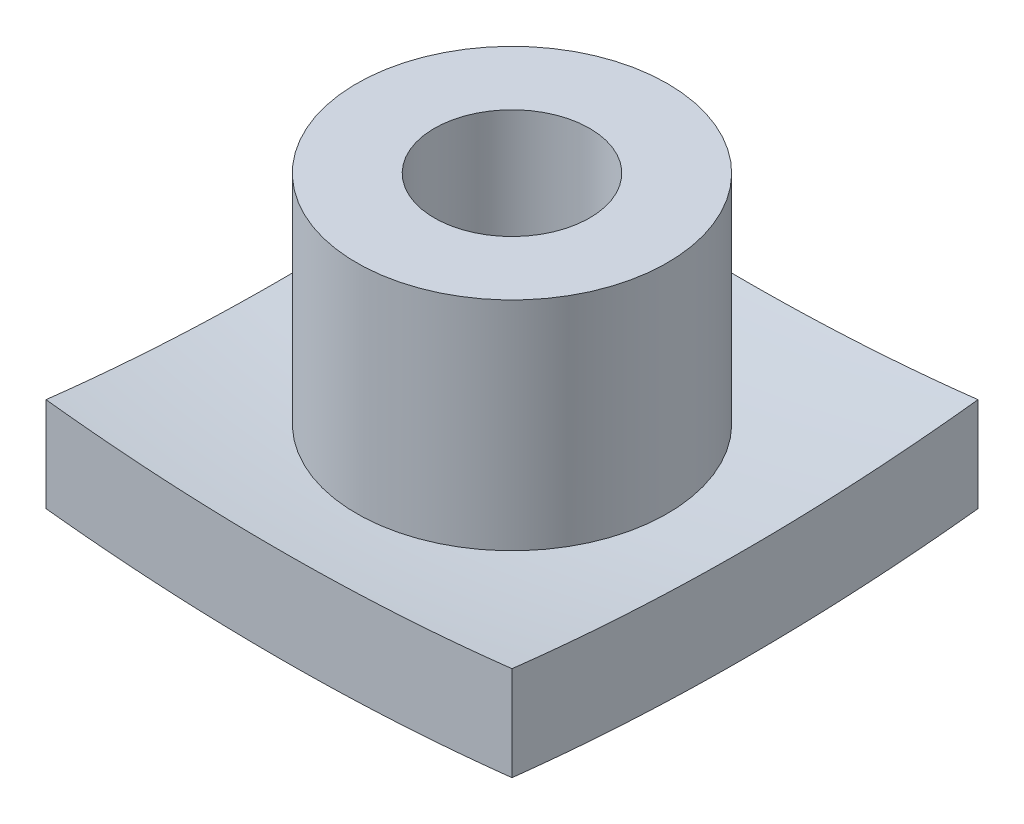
ISO-10303-21;
HEADER;
FILE_DESCRIPTION(('STEP AP214'),'2;1');
FILE_NAME('part.step','',(''),(''),'','','');
FILE_SCHEMA(('AUTOMOTIVE_DESIGN { 1 0 10303 214 1 1 1 1 }'));
ENDSEC;
DATA;
#1=APPLICATION_CONTEXT('core data for automotive mechanical design processes');
#2=APPLICATION_PROTOCOL_DEFINITION('international standard','automotive_design',2000,#1);
#3=PRODUCT_CONTEXT('',#1,'mechanical');
#4=PRODUCT('Part','Part','',(#3));
#5=PRODUCT_RELATED_PRODUCT_CATEGORY('part','',(#4));
#6=PRODUCT_DEFINITION_FORMATION('','',#4);
#7=PRODUCT_DEFINITION_CONTEXT('part definition',#1,'design');
#8=PRODUCT_DEFINITION('design','',#6,#7);
#9=PRODUCT_DEFINITION_SHAPE('','',#8);
#10=(LENGTH_UNIT() NAMED_UNIT(*) SI_UNIT(.MILLI.,.METRE.));
#11=(NAMED_UNIT(*) PLANE_ANGLE_UNIT() SI_UNIT($,.RADIAN.));
#12=(NAMED_UNIT(*) SI_UNIT($,.STERADIAN.) SOLID_ANGLE_UNIT());
#13=UNCERTAINTY_MEASURE_WITH_UNIT(LENGTH_MEASURE(1.E-05),#10,'distance_accuracy_value','');
#14=(GEOMETRIC_REPRESENTATION_CONTEXT(3) GLOBAL_UNCERTAINTY_ASSIGNED_CONTEXT((#13)) GLOBAL_UNIT_ASSIGNED_CONTEXT((#10,
#11,#12)) REPRESENTATION_CONTEXT('',''));
#15=CARTESIAN_POINT('',(0.,0.,0.));
#16=DIRECTION('',(0.,0.,1.));
#17=DIRECTION('',(1.,0.,0.));
#18=AXIS2_PLACEMENT_3D('',#15,#16,#17);
#19=CARTESIAN_POINT('',(3.,4.,3.));
#20=DIRECTION('',(-1.,0.,0.));
#21=DIRECTION('',(0.,0.,1.));
#22=AXIS2_PLACEMENT_3D('',#19,#20,#21);
#23=PLANE('',#22);
#24=CARTESIAN_POINT('',(3.,27.1333230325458,0.));
#25=DIRECTION('',(-1.,0.,0.));
#26=DIRECTION('',(0.,0.,1.));
#27=AXIS2_PLACEMENT_3D('',#24,#25,#26);
#28=CIRCLE('',#27,25.8333230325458);
#29=CARTESIAN_POINT('',(3.,1.47478490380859,3.));
#30=VERTEX_POINT('',#29);
#31=CARTESIAN_POINT('',(3.,1.47478490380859,-3.));
#32=VERTEX_POINT('',#31);
#33=EDGE_CURVE('E73',#30,#32,#28,.F.);
#34=ORIENTED_EDGE('',*,*,#33,.F.);
#35=DIRECTION('',(0.,-1.,0.));
#36=VECTOR('',#35,1.);
#37=CARTESIAN_POINT('',(3.,4.,3.));
#38=LINE('',#37,#36);
#39=CARTESIAN_POINT('',(3.,0.259223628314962,3.));
#40=VERTEX_POINT('',#39);
#41=EDGE_CURVE('E55',#30,#40,#38,.T.);
#42=ORIENTED_EDGE('',*,*,#41,.T.);
#43=CARTESIAN_POINT('',(3.,27.1333230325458,0.));
#44=DIRECTION('',(-1.,0.,0.));
#45=DIRECTION('',(0.,0.,1.));
#46=AXIS2_PLACEMENT_3D('',#43,#44,#45);
#47=CIRCLE('',#46,27.0410284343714);
#48=CARTESIAN_POINT('',(3.,0.259223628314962,-3.));
#49=VERTEX_POINT('',#48);
#50=EDGE_CURVE('E86',#49,#40,#47,.T.);
#51=ORIENTED_EDGE('',*,*,#50,.F.);
#52=DIRECTION('',(0.,-1.,0.));
#53=VECTOR('',#52,1.);
#54=CARTESIAN_POINT('',(3.,4.,-3.));
#55=LINE('',#54,#53);
#56=EDGE_CURVE('E41',#32,#49,#55,.T.);
#57=ORIENTED_EDGE('',*,*,#56,.F.);
#58=EDGE_LOOP('',(#34,#42,#51,#57));
#59=FACE_BOUND('',#58,.T.);
#60=ADVANCED_FACE('F34',(#59),#23,.F.);
#61=CARTESIAN_POINT('',(-3.,4.,-3.));
#62=DIRECTION('',(0.,0.,1.));
#63=DIRECTION('',(1.,0.,0.));
#64=AXIS2_PLACEMENT_3D('',#61,#62,#63);
#65=PLANE('',#64);
#66=CARTESIAN_POINT('',(0.,27.1333230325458,-3.));
#67=DIRECTION('',(0.,0.,1.));
#68=DIRECTION('',(1.,0.,0.));
#69=AXIS2_PLACEMENT_3D('',#66,#67,#68);
#70=CIRCLE('',#69,25.8333230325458);
#71=CARTESIAN_POINT('',(-3.,1.47478490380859,-3.));
#72=VERTEX_POINT('',#71);
#73=EDGE_CURVE('E79',#32,#72,#70,.F.);
#74=ORIENTED_EDGE('',*,*,#73,.F.);
#75=ORIENTED_EDGE('',*,*,#56,.T.);
#76=CARTESIAN_POINT('',(0.,27.1333230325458,-3.));
#77=DIRECTION('',(0.,0.,1.));
#78=DIRECTION('',(1.,0.,0.));
#79=AXIS2_PLACEMENT_3D('',#76,#77,#78);
#80=CIRCLE('',#79,27.0410284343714);
#81=CARTESIAN_POINT('',(-3.,0.259223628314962,-3.));
#82=VERTEX_POINT('',#81);
#83=EDGE_CURVE('E90',#82,#49,#80,.T.);
#84=ORIENTED_EDGE('',*,*,#83,.F.);
#85=DIRECTION('',(0.,-1.,0.));
#86=VECTOR('',#85,1.);
#87=CARTESIAN_POINT('',(-3.,4.,-3.));
#88=LINE('',#87,#86);
#89=EDGE_CURVE('E88',#72,#82,#88,.T.);
#90=ORIENTED_EDGE('',*,*,#89,.F.);
#91=EDGE_LOOP('',(#74,#75,#84,#90));
#92=FACE_BOUND('',#91,.T.);
#93=ADVANCED_FACE('F97',(#92),#65,.F.);
#94=CARTESIAN_POINT('',(-3.,4.,3.));
#95=DIRECTION('',(1.,0.,0.));
#96=DIRECTION('',(0.,0.,-1.));
#97=AXIS2_PLACEMENT_3D('',#94,#95,#96);
#98=PLANE('',#97);
#99=CARTESIAN_POINT('',(-3.,27.1333230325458,0.));
#100=DIRECTION('',(1.,0.,0.));
#101=DIRECTION('',(0.,0.,-1.));
#102=AXIS2_PLACEMENT_3D('',#99,#100,#101);
#103=CIRCLE('',#102,25.8333230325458);
#104=CARTESIAN_POINT('',(-3.,1.47478490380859,3.));
#105=VERTEX_POINT('',#104);
#106=EDGE_CURVE('E47',#72,#105,#103,.F.);
#107=ORIENTED_EDGE('',*,*,#106,.F.);
#108=ORIENTED_EDGE('',*,*,#89,.T.);
#109=CARTESIAN_POINT('',(-3.,27.1333230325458,0.));
#110=DIRECTION('',(1.,0.,0.));
#111=DIRECTION('',(0.,0.,-1.));
#112=AXIS2_PLACEMENT_3D('',#109,#110,#111);
#113=CIRCLE('',#112,27.0410284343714);
#114=CARTESIAN_POINT('',(-3.,0.259223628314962,3.));
#115=VERTEX_POINT('',#114);
#116=EDGE_CURVE('E103',#115,#82,#113,.T.);
#117=ORIENTED_EDGE('',*,*,#116,.F.);
#118=DIRECTION('',(0.,-1.,0.));
#119=VECTOR('',#118,1.);
#120=CARTESIAN_POINT('',(-3.,4.,3.));
#121=LINE('',#120,#119);
#122=EDGE_CURVE('E85',#105,#115,#121,.T.);
#123=ORIENTED_EDGE('',*,*,#122,.F.);
#124=EDGE_LOOP('',(#107,#108,#117,#123));
#125=FACE_BOUND('',#124,.T.);
#126=ADVANCED_FACE('F144',(#125),#98,.F.);
#127=CARTESIAN_POINT('',(-3.,4.,3.));
#128=DIRECTION('',(0.,0.,-1.));
#129=DIRECTION('',(-1.,0.,0.));
#130=AXIS2_PLACEMENT_3D('',#127,#128,#129);
#131=PLANE('',#130);
#132=CARTESIAN_POINT('',(0.,27.1333230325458,3.));
#133=DIRECTION('',(0.,0.,-1.));
#134=DIRECTION('',(-1.,0.,0.));
#135=AXIS2_PLACEMENT_3D('',#132,#133,#134);
#136=CIRCLE('',#135,25.8333230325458);
#137=EDGE_CURVE('E11',#105,#30,#136,.F.);
#138=ORIENTED_EDGE('',*,*,#137,.F.);
#139=ORIENTED_EDGE('',*,*,#122,.T.);
#140=CARTESIAN_POINT('',(0.,27.1333230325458,3.));
#141=DIRECTION('',(0.,0.,-1.));
#142=DIRECTION('',(-1.,0.,0.));
#143=AXIS2_PLACEMENT_3D('',#140,#141,#142);
#144=CIRCLE('',#143,27.0410284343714);
#145=EDGE_CURVE('E84',#40,#115,#144,.T.);
#146=ORIENTED_EDGE('',*,*,#145,.F.);
#147=ORIENTED_EDGE('',*,*,#41,.F.);
#148=EDGE_LOOP('',(#138,#139,#146,#147));
#149=FACE_BOUND('',#148,.T.);
#150=ADVANCED_FACE('F82',(#149),#131,.F.);
#151=CARTESIAN_POINT('',(0.,27.1333230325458,0.));
#152=DIRECTION('',(0.,-1.,0.));
#153=DIRECTION('',(-1.,0.,0.));
#154=AXIS2_PLACEMENT_3D('',#151,#152,#153);
#155=SPHERICAL_SURFACE('',#154,27.206933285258);
#156=CARTESIAN_POINT('',(0.,0.,0.));
#157=DIRECTION('',(0.,-1.,0.));
#158=DIRECTION('',(0.,0.,-1.));
#159=AXIS2_PLACEMENT_3D('',#156,#157,#158);
#160=CIRCLE('',#159,2.);
#161=CARTESIAN_POINT('',(0.,0.,-2.));
#162=VERTEX_POINT('',#161);
#163=EDGE_CURVE('E78',#162,#162,#160,.T.);
#164=ORIENTED_EDGE('',*,*,#163,.F.);
#165=EDGE_LOOP('',(#164));
#166=FACE_BOUND('',#165,.T.);
#167=ORIENTED_EDGE('',*,*,#50,.T.);
#168=ORIENTED_EDGE('',*,*,#145,.T.);
#169=ORIENTED_EDGE('',*,*,#116,.T.);
#170=ORIENTED_EDGE('',*,*,#83,.T.);
#171=EDGE_LOOP('',(#167,#168,#169,#170));
#172=FACE_BOUND('',#171,.T.);
#173=ADVANCED_FACE('F101',(#166,#172),#155,.T.);
#174=CARTESIAN_POINT('',(3.,0.,-3.));
#175=DIRECTION('',(0.,-1.,0.));
#176=DIRECTION('',(0.,0.,-1.));
#177=AXIS2_PLACEMENT_3D('',#174,#175,#176);
#178=PLANE('',#177);
#179=CARTESIAN_POINT('',(0.,0.,0.));
#180=DIRECTION('',(0.,-1.,0.));
#181=DIRECTION('',(0.,0.,-1.));
#182=AXIS2_PLACEMENT_3D('',#179,#180,#181);
#183=CIRCLE('',#182,1.);
#184=CARTESIAN_POINT('',(0.,0.,-1.));
#185=VERTEX_POINT('',#184);
#186=EDGE_CURVE('E118',#185,#185,#183,.T.);
#187=ORIENTED_EDGE('',*,*,#186,.F.);
#188=EDGE_LOOP('',(#187));
#189=FACE_BOUND('',#188,.T.);
#190=ORIENTED_EDGE('',*,*,#163,.T.);
#191=EDGE_LOOP('',(#190));
#192=FACE_BOUND('',#191,.T.);
#193=ADVANCED_FACE('F133',(#189,#192),#178,.T.);
#194=CARTESIAN_POINT('',(0.,27.1333230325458,0.));
#195=DIRECTION('',(0.,-1.,0.));
#196=DIRECTION('',(-1.,0.,0.));
#197=AXIS2_PLACEMENT_3D('',#194,#195,#196);
#198=SPHERICAL_SURFACE('',#197,26.006933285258);
#199=CARTESIAN_POINT('',(0.,1.2034063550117,0.));
#200=DIRECTION('',(0.,-1.,0.));
#201=DIRECTION('',(0.,0.,-1.));
#202=AXIS2_PLACEMENT_3D('',#199,#200,#201);
#203=CIRCLE('',#202,2.);
#204=CARTESIAN_POINT('',(0.,1.2034063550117,-2.));
#205=VERTEX_POINT('',#204);
#206=EDGE_CURVE('E111',#205,#205,#203,.T.);
#207=ORIENTED_EDGE('',*,*,#206,.T.);
#208=EDGE_LOOP('',(#207));
#209=FACE_BOUND('',#208,.T.);
#210=ORIENTED_EDGE('',*,*,#33,.T.);
#211=ORIENTED_EDGE('',*,*,#73,.T.);
#212=ORIENTED_EDGE('',*,*,#106,.T.);
#213=ORIENTED_EDGE('',*,*,#137,.T.);
#214=EDGE_LOOP('',(#210,#211,#212,#213));
#215=FACE_BOUND('',#214,.T.);
#216=ADVANCED_FACE('F72',(#209,#215),#198,.F.);
#217=CARTESIAN_POINT('',(0.,0.,0.));
#218=DIRECTION('',(0.,-1.,0.));
#219=DIRECTION('',(0.,0.,-1.));
#220=AXIS2_PLACEMENT_3D('',#217,#218,#219);
#221=CYLINDRICAL_SURFACE('',#220,2.);
#222=CARTESIAN_POINT('',(0.,4.,0.));
#223=DIRECTION('',(0.,-1.,0.));
#224=DIRECTION('',(0.,0.,-1.));
#225=AXIS2_PLACEMENT_3D('',#222,#223,#224);
#226=CIRCLE('',#225,2.);
#227=CARTESIAN_POINT('',(0.,4.,-2.));
#228=VERTEX_POINT('',#227);
#229=EDGE_CURVE('E114',#228,#228,#226,.T.);
#230=ORIENTED_EDGE('',*,*,#229,.T.);
#231=EDGE_LOOP('',(#230));
#232=FACE_BOUND('',#231,.T.);
#233=ORIENTED_EDGE('',*,*,#206,.F.);
#234=EDGE_LOOP('',(#233));
#235=FACE_BOUND('',#234,.T.);
#236=ADVANCED_FACE('F158',(#232,#235),#221,.T.);
#237=CARTESIAN_POINT('',(3.,4.,-3.));
#238=DIRECTION('',(0.,-1.,0.));
#239=DIRECTION('',(0.,0.,-1.));
#240=AXIS2_PLACEMENT_3D('',#237,#238,#239);
#241=PLANE('',#240);
#242=CARTESIAN_POINT('',(0.,4.,0.));
#243=DIRECTION('',(0.,-1.,0.));
#244=DIRECTION('',(0.,0.,-1.));
#245=AXIS2_PLACEMENT_3D('',#242,#243,#244);
#246=CIRCLE('',#245,1.);
#247=CARTESIAN_POINT('',(0.,4.,-1.));
#248=VERTEX_POINT('',#247);
#249=EDGE_CURVE('E117',#248,#248,#246,.T.);
#250=ORIENTED_EDGE('',*,*,#249,.T.);
#251=EDGE_LOOP('',(#250));
#252=FACE_BOUND('',#251,.T.);
#253=ORIENTED_EDGE('',*,*,#229,.F.);
#254=EDGE_LOOP('',(#253));
#255=FACE_BOUND('',#254,.T.);
#256=ADVANCED_FACE('F124',(#252,#255),#241,.F.);
#257=CARTESIAN_POINT('',(0.,4.,0.));
#258=DIRECTION('',(0.,-1.,0.));
#259=DIRECTION('',(0.,0.,-1.));
#260=AXIS2_PLACEMENT_3D('',#257,#258,#259);
#261=CYLINDRICAL_SURFACE('',#260,1.);
#262=ORIENTED_EDGE('',*,*,#249,.F.);
#263=EDGE_LOOP('',(#262));
#264=FACE_BOUND('',#263,.T.);
#265=ORIENTED_EDGE('',*,*,#186,.T.);
#266=EDGE_LOOP('',(#265));
#267=FACE_BOUND('',#266,.T.);
#268=ADVANCED_FACE('F127',(#264,#267),#261,.F.);
#269=CLOSED_SHELL('',(#60,#93,#126,#150,#173,#193,#216,#236,#256,#268));
#270=MANIFOLD_SOLID_BREP('B2',#269);
#271=ADVANCED_BREP_SHAPE_REPRESENTATION('',(#18,#270),#14);
#272=SHAPE_DEFINITION_REPRESENTATION(#9,#271);
ENDSEC;
END-ISO-10303-21;
